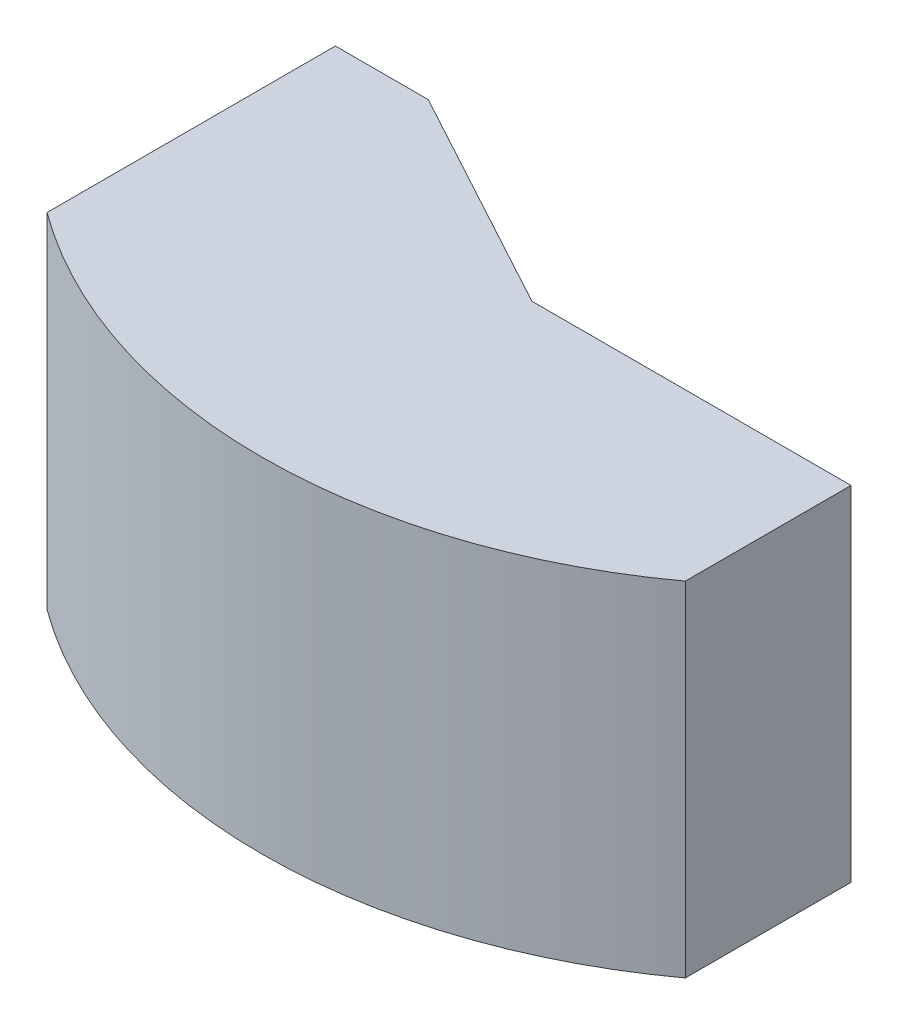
from build123d import *

# Parameters (mm, degrees)
CUT_EXTRUDE1_DEPTH = 217.645770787


with BuildPart() as part:
    # Sketch1 → Revolve1 (revolve)
    with BuildSketch(Plane.XY, mode=Mode.PRIVATE) as revolve1_sk:
        Polygon((-38.1, 2.54), (-38.1, 78.74), (-41.275, 78.74), (-53.975, 91.44), (-139.7, 91.44), (-139.7, 2.54), align=None)
    revolve(revolve1_sk.sketch.rotate(Axis((0, 0, 0), (0, 1, 0)), 270), axis=Axis((0, 0, 0), (0, 1, 0)))

    # Sketch2 → Cut-Extrude1 (cut, through all)
    with BuildSketch(Plane.XZ.offset(-91.44)):
        with BuildLine():
            Line((-152.4, 171.960607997), (-152.4, 130.656214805))
            ThreePointArc((-152.4, 130.656214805), (43.637653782, -195.940199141), (82.55, 182.981703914))
            Line((82.55, 182.981703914), (82.55, 69.85))
            Line((82.55, 69.85), (0, 69.85))
            Line((0, 69.85), (-58.544107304, 38.1))
            Line((-58.544107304, 38.1), (-82.55, 38.1))
            Line((-82.55, 38.1), (-82.55, 171.960607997))
            Line((-82.55, 171.960607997), (-152.4, 171.960607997))
        make_face()
    extrude(amount=CUT_EXTRUDE1_DEPTH, mode=Mode.SUBTRACT)


solid = part.part
